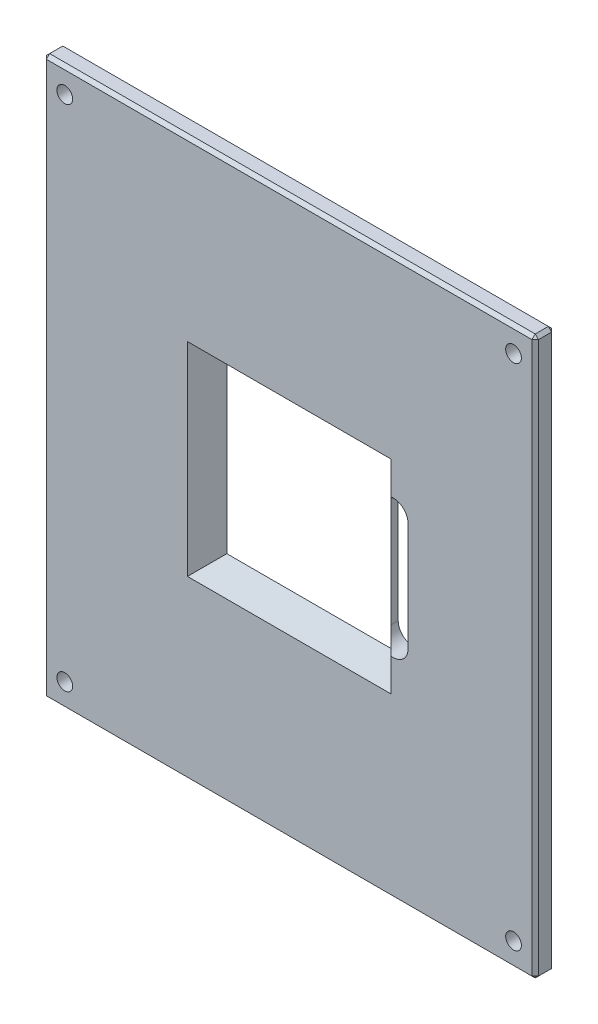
ISO-10303-21;
HEADER;
FILE_DESCRIPTION(('STEP AP214'),'2;1');
FILE_NAME('part.step','',(''),(''),'','','');
FILE_SCHEMA(('AUTOMOTIVE_DESIGN { 1 0 10303 214 1 1 1 1 }'));
ENDSEC;
DATA;
#1=APPLICATION_CONTEXT('core data for automotive mechanical design processes');
#2=APPLICATION_PROTOCOL_DEFINITION('international standard','automotive_design',2000,#1);
#3=PRODUCT_CONTEXT('',#1,'mechanical');
#4=PRODUCT('Part','Part','',(#3));
#5=PRODUCT_RELATED_PRODUCT_CATEGORY('part','',(#4));
#6=PRODUCT_DEFINITION_FORMATION('','',#4);
#7=PRODUCT_DEFINITION_CONTEXT('part definition',#1,'design');
#8=PRODUCT_DEFINITION('design','',#6,#7);
#9=PRODUCT_DEFINITION_SHAPE('','',#8);
#10=(LENGTH_UNIT() NAMED_UNIT(*) SI_UNIT(.MILLI.,.METRE.));
#11=(NAMED_UNIT(*) PLANE_ANGLE_UNIT() SI_UNIT($,.RADIAN.));
#12=(NAMED_UNIT(*) SI_UNIT($,.STERADIAN.) SOLID_ANGLE_UNIT());
#13=UNCERTAINTY_MEASURE_WITH_UNIT(LENGTH_MEASURE(1.E-05),#10,'distance_accuracy_value','');
#14=(GEOMETRIC_REPRESENTATION_CONTEXT(3) GLOBAL_UNCERTAINTY_ASSIGNED_CONTEXT((#13)) GLOBAL_UNIT_ASSIGNED_CONTEXT((#10,
#11,#12)) REPRESENTATION_CONTEXT('',''));
#15=CARTESIAN_POINT('',(0.,0.,0.));
#16=DIRECTION('',(0.,0.,1.));
#17=DIRECTION('',(1.,0.,0.));
#18=AXIS2_PLACEMENT_3D('',#15,#16,#17);
#19=CARTESIAN_POINT('',(0.,0.,3.));
#20=DIRECTION('',(0.,0.,-1.));
#21=DIRECTION('',(-1.,0.,0.));
#22=AXIS2_PLACEMENT_3D('',#19,#20,#21);
#23=PLANE('',#22);
#24=CARTESIAN_POINT('',(15.87,-8.28,3.));
#25=DIRECTION('',(0.,0.,1.));
#26=DIRECTION('',(1.,0.,0.));
#27=AXIS2_PLACEMENT_3D('',#24,#25,#26);
#28=CIRCLE('',#27,2.25);
#29=CARTESIAN_POINT('',(15.5,-10.499369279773,3.));
#30=VERTEX_POINT('',#29);
#31=CARTESIAN_POINT('',(18.12,-8.28,3.));
#32=VERTEX_POINT('',#31);
#33=EDGE_CURVE('E205',#30,#32,#28,.T.);
#34=ORIENTED_EDGE('',*,*,#33,.F.);
#35=DIRECTION('',(0.,-1.,0.));
#36=VECTOR('',#35,1.);
#37=CARTESIAN_POINT('',(15.5,-12.5,3.));
#38=LINE('',#37,#36);
#39=CARTESIAN_POINT('',(15.5,-15.5,3.));
#40=VERTEX_POINT('',#39);
#41=EDGE_CURVE('E382',#30,#40,#38,.T.);
#42=ORIENTED_EDGE('',*,*,#41,.T.);
#43=DIRECTION('',(-1.,0.,0.));
#44=VECTOR('',#43,1.);
#45=CARTESIAN_POINT('',(-12.5,-15.5,3.));
#46=LINE('',#45,#44);
#47=CARTESIAN_POINT('',(-15.5,-15.5,3.));
#48=VERTEX_POINT('',#47);
#49=EDGE_CURVE('E380',#40,#48,#46,.T.);
#50=ORIENTED_EDGE('',*,*,#49,.T.);
#51=DIRECTION('',(0.,1.,0.));
#52=VECTOR('',#51,1.);
#53=CARTESIAN_POINT('',(-15.5,12.5,3.));
#54=LINE('',#53,#52);
#55=CARTESIAN_POINT('',(-15.5,15.5,3.));
#56=VERTEX_POINT('',#55);
#57=EDGE_CURVE('E377',#48,#56,#54,.T.);
#58=ORIENTED_EDGE('',*,*,#57,.T.);
#59=DIRECTION('',(1.,0.,0.));
#60=VECTOR('',#59,1.);
#61=CARTESIAN_POINT('',(12.5,15.5,3.));
#62=LINE('',#61,#60);
#63=CARTESIAN_POINT('',(15.5,15.5,3.));
#64=VERTEX_POINT('',#63);
#65=EDGE_CURVE('E307',#56,#64,#62,.T.);
#66=ORIENTED_EDGE('',*,*,#65,.T.);
#67=DIRECTION('',(0.,-1.,0.));
#68=VECTOR('',#67,1.);
#69=CARTESIAN_POINT('',(15.5,-12.5,3.));
#70=LINE('',#69,#68);
#71=CARTESIAN_POINT('',(15.5,10.499369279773,3.));
#72=VERTEX_POINT('',#71);
#73=EDGE_CURVE('E375',#64,#72,#70,.T.);
#74=ORIENTED_EDGE('',*,*,#73,.T.);
#75=CARTESIAN_POINT('',(15.87,8.28,3.));
#76=DIRECTION('',(0.,0.,1.));
#77=DIRECTION('',(1.,0.,0.));
#78=AXIS2_PLACEMENT_3D('',#75,#76,#77);
#79=CIRCLE('',#78,2.25);
#80=CARTESIAN_POINT('',(18.12,8.28,3.));
#81=VERTEX_POINT('',#80);
#82=EDGE_CURVE('E210',#81,#72,#79,.T.);
#83=ORIENTED_EDGE('',*,*,#82,.F.);
#84=DIRECTION('',(0.,1.,0.));
#85=VECTOR('',#84,1.);
#86=CARTESIAN_POINT('',(18.12,8.28,3.));
#87=LINE('',#86,#85);
#88=EDGE_CURVE('E202',#32,#81,#87,.T.);
#89=ORIENTED_EDGE('',*,*,#88,.F.);
#90=EDGE_LOOP('',(#34,#42,#50,#58,#66,#74,#83,#89));
#91=FACE_BOUND('',#90,.T.);
#92=DIRECTION('',(0.,-1.,0.));
#93=VECTOR('',#92,1.);
#94=CARTESIAN_POINT('',(-37.,0.,3.));
#95=LINE('',#94,#93);
#96=CARTESIAN_POINT('',(-37.,42.,3.));
#97=VERTEX_POINT('',#96);
#98=CARTESIAN_POINT('',(-37.,-42.,3.));
#99=VERTEX_POINT('',#98);
#100=EDGE_CURVE('E302',#97,#99,#95,.T.);
#101=ORIENTED_EDGE('',*,*,#100,.T.);
#102=DIRECTION('',(1.,0.,0.));
#103=VECTOR('',#102,1.);
#104=CARTESIAN_POINT('',(0.,-42.,3.));
#105=LINE('',#104,#103);
#106=CARTESIAN_POINT('',(37.,-42.,3.));
#107=VERTEX_POINT('',#106);
#108=EDGE_CURVE('E304',#99,#107,#105,.T.);
#109=ORIENTED_EDGE('',*,*,#108,.T.);
#110=DIRECTION('',(0.,1.,0.));
#111=VECTOR('',#110,1.);
#112=CARTESIAN_POINT('',(37.,0.,3.));
#113=LINE('',#112,#111);
#114=CARTESIAN_POINT('',(37.,42.,3.));
#115=VERTEX_POINT('',#114);
#116=EDGE_CURVE('E298',#107,#115,#113,.T.);
#117=ORIENTED_EDGE('',*,*,#116,.T.);
#118=DIRECTION('',(-1.,0.,0.));
#119=VECTOR('',#118,1.);
#120=CARTESIAN_POINT('',(0.,42.,3.));
#121=LINE('',#120,#119);
#122=EDGE_CURVE('E300',#115,#97,#121,.T.);
#123=ORIENTED_EDGE('',*,*,#122,.T.);
#124=EDGE_LOOP('',(#101,#109,#117,#123));
#125=FACE_BOUND('',#124,.T.);
#126=CARTESIAN_POINT('',(-34.1918918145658,38.7508107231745,3.));
#127=DIRECTION('',(0.,0.,1.));
#128=DIRECTION('',(1.,0.,0.));
#129=AXIS2_PLACEMENT_3D('',#126,#127,#128);
#130=CIRCLE('',#129,1.2);
#131=CARTESIAN_POINT('',(-32.9918918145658,38.7508107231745,3.));
#132=VERTEX_POINT('',#131);
#133=EDGE_CURVE('E216',#132,#132,#130,.T.);
#134=ORIENTED_EDGE('',*,*,#133,.F.);
#135=EDGE_LOOP('',(#134));
#136=FACE_BOUND('',#135,.T.);
#137=CARTESIAN_POINT('',(34.1918918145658,38.7508107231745,3.));
#138=DIRECTION('',(0.,0.,1.));
#139=DIRECTION('',(1.,0.,0.));
#140=AXIS2_PLACEMENT_3D('',#137,#138,#139);
#141=CIRCLE('',#140,1.2);
#142=CARTESIAN_POINT('',(35.3918918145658,38.7508107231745,3.));
#143=VERTEX_POINT('',#142);
#144=EDGE_CURVE('E226',#143,#143,#141,.T.);
#145=ORIENTED_EDGE('',*,*,#144,.F.);
#146=EDGE_LOOP('',(#145));
#147=FACE_BOUND('',#146,.T.);
#148=CARTESIAN_POINT('',(-34.1918918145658,-38.7508107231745,3.));
#149=DIRECTION('',(0.,0.,1.));
#150=DIRECTION('',(1.,0.,0.));
#151=AXIS2_PLACEMENT_3D('',#148,#149,#150);
#152=CIRCLE('',#151,1.2);
#153=CARTESIAN_POINT('',(-32.9918918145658,-38.7508107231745,3.));
#154=VERTEX_POINT('',#153);
#155=EDGE_CURVE('E232',#154,#154,#152,.T.);
#156=ORIENTED_EDGE('',*,*,#155,.F.);
#157=EDGE_LOOP('',(#156));
#158=FACE_BOUND('',#157,.T.);
#159=CARTESIAN_POINT('',(34.1918918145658,-38.7508107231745,3.));
#160=DIRECTION('',(0.,0.,1.));
#161=DIRECTION('',(1.,0.,0.));
#162=AXIS2_PLACEMENT_3D('',#159,#160,#161);
#163=CIRCLE('',#162,1.2);
#164=CARTESIAN_POINT('',(35.3918918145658,-38.7508107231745,3.));
#165=VERTEX_POINT('',#164);
#166=EDGE_CURVE('E238',#165,#165,#163,.T.);
#167=ORIENTED_EDGE('',*,*,#166,.F.);
#168=EDGE_LOOP('',(#167));
#169=FACE_BOUND('',#168,.T.);
#170=ADVANCED_FACE('F39',(#91,#125,#136,#147,#158,#169),#23,.F.);
#171=CARTESIAN_POINT('',(0.,0.,0.));
#172=DIRECTION('',(0.,0.,-1.));
#173=DIRECTION('',(-1.,0.,0.));
#174=AXIS2_PLACEMENT_3D('',#171,#172,#173);
#175=PLANE('',#174);
#176=DIRECTION('',(0.,1.,0.));
#177=VECTOR('',#176,1.);
#178=CARTESIAN_POINT('',(-37.,42.5,0.));
#179=LINE('',#178,#177);
#180=CARTESIAN_POINT('',(-37.,-42.,0.));
#181=VERTEX_POINT('',#180);
#182=CARTESIAN_POINT('',(-37.,42.,0.));
#183=VERTEX_POINT('',#182);
#184=EDGE_CURVE('E266',#181,#183,#179,.T.);
#185=ORIENTED_EDGE('',*,*,#184,.T.);
#186=DIRECTION('',(1.,0.,0.));
#187=VECTOR('',#186,1.);
#188=CARTESIAN_POINT('',(37.5,42.,0.));
#189=LINE('',#188,#187);
#190=CARTESIAN_POINT('',(37.,42.,0.));
#191=VERTEX_POINT('',#190);
#192=EDGE_CURVE('E268',#183,#191,#189,.T.);
#193=ORIENTED_EDGE('',*,*,#192,.T.);
#194=DIRECTION('',(0.,-1.,0.));
#195=VECTOR('',#194,1.);
#196=CARTESIAN_POINT('',(37.,-42.5,0.));
#197=LINE('',#196,#195);
#198=CARTESIAN_POINT('',(37.,-42.,0.));
#199=VERTEX_POINT('',#198);
#200=EDGE_CURVE('E262',#191,#199,#197,.T.);
#201=ORIENTED_EDGE('',*,*,#200,.T.);
#202=DIRECTION('',(-1.,0.,0.));
#203=VECTOR('',#202,1.);
#204=CARTESIAN_POINT('',(-37.5,-42.,0.));
#205=LINE('',#204,#203);
#206=EDGE_CURVE('E264',#199,#181,#205,.T.);
#207=ORIENTED_EDGE('',*,*,#206,.T.);
#208=EDGE_LOOP('',(#185,#193,#201,#207));
#209=FACE_BOUND('',#208,.T.);
#210=CARTESIAN_POINT('',(15.87,8.28,0.));
#211=DIRECTION('',(0.,0.,1.));
#212=DIRECTION('',(1.,0.,0.));
#213=AXIS2_PLACEMENT_3D('',#210,#211,#212);
#214=CIRCLE('',#213,2.25);
#215=CARTESIAN_POINT('',(18.12,8.28,0.));
#216=VERTEX_POINT('',#215);
#217=CARTESIAN_POINT('',(13.62,8.28,0.));
#218=VERTEX_POINT('',#217);
#219=EDGE_CURVE('E187',#216,#218,#214,.T.);
#220=ORIENTED_EDGE('',*,*,#219,.T.);
#221=DIRECTION('',(0.,-1.,0.));
#222=VECTOR('',#221,1.);
#223=CARTESIAN_POINT('',(13.62,8.28,0.));
#224=LINE('',#223,#222);
#225=CARTESIAN_POINT('',(13.62,-8.28,0.));
#226=VERTEX_POINT('',#225);
#227=EDGE_CURVE('E193',#218,#226,#224,.T.);
#228=ORIENTED_EDGE('',*,*,#227,.T.);
#229=CARTESIAN_POINT('',(15.87,-8.28,0.));
#230=DIRECTION('',(0.,0.,1.));
#231=DIRECTION('',(1.,0.,0.));
#232=AXIS2_PLACEMENT_3D('',#229,#230,#231);
#233=CIRCLE('',#232,2.25);
#234=CARTESIAN_POINT('',(18.12,-8.28,0.));
#235=VERTEX_POINT('',#234);
#236=EDGE_CURVE('E197',#226,#235,#233,.T.);
#237=ORIENTED_EDGE('',*,*,#236,.T.);
#238=DIRECTION('',(0.,1.,0.));
#239=VECTOR('',#238,1.);
#240=CARTESIAN_POINT('',(18.12,8.28,0.));
#241=LINE('',#240,#239);
#242=EDGE_CURVE('E190',#235,#216,#241,.T.);
#243=ORIENTED_EDGE('',*,*,#242,.T.);
#244=EDGE_LOOP('',(#220,#228,#237,#243));
#245=FACE_BOUND('',#244,.T.);
#246=CARTESIAN_POINT('',(-34.1918918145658,38.7508107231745,0.));
#247=DIRECTION('',(0.,0.,1.));
#248=DIRECTION('',(1.,0.,0.));
#249=AXIS2_PLACEMENT_3D('',#246,#247,#248);
#250=CIRCLE('',#249,1.2);
#251=CARTESIAN_POINT('',(-32.9918918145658,38.7508107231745,0.));
#252=VERTEX_POINT('',#251);
#253=EDGE_CURVE('E223',#252,#252,#250,.T.);
#254=ORIENTED_EDGE('',*,*,#253,.T.);
#255=EDGE_LOOP('',(#254));
#256=FACE_BOUND('',#255,.T.);
#257=CARTESIAN_POINT('',(34.1918918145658,38.7508107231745,0.));
#258=DIRECTION('',(0.,0.,1.));
#259=DIRECTION('',(1.,0.,0.));
#260=AXIS2_PLACEMENT_3D('',#257,#258,#259);
#261=CIRCLE('',#260,1.2);
#262=CARTESIAN_POINT('',(35.3918918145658,38.7508107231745,0.));
#263=VERTEX_POINT('',#262);
#264=EDGE_CURVE('E229',#263,#263,#261,.T.);
#265=ORIENTED_EDGE('',*,*,#264,.T.);
#266=EDGE_LOOP('',(#265));
#267=FACE_BOUND('',#266,.T.);
#268=CARTESIAN_POINT('',(-34.1918918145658,-38.7508107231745,0.));
#269=DIRECTION('',(0.,0.,1.));
#270=DIRECTION('',(1.,0.,0.));
#271=AXIS2_PLACEMENT_3D('',#268,#269,#270);
#272=CIRCLE('',#271,1.2);
#273=CARTESIAN_POINT('',(-32.9918918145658,-38.7508107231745,0.));
#274=VERTEX_POINT('',#273);
#275=EDGE_CURVE('E235',#274,#274,#272,.T.);
#276=ORIENTED_EDGE('',*,*,#275,.T.);
#277=EDGE_LOOP('',(#276));
#278=FACE_BOUND('',#277,.T.);
#279=CARTESIAN_POINT('',(34.1918918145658,-38.7508107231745,0.));
#280=DIRECTION('',(0.,0.,1.));
#281=DIRECTION('',(1.,0.,0.));
#282=AXIS2_PLACEMENT_3D('',#279,#280,#281);
#283=CIRCLE('',#282,1.2);
#284=CARTESIAN_POINT('',(35.3918918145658,-38.7508107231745,0.));
#285=VERTEX_POINT('',#284);
#286=EDGE_CURVE('E241',#285,#285,#283,.T.);
#287=ORIENTED_EDGE('',*,*,#286,.T.);
#288=EDGE_LOOP('',(#287));
#289=FACE_BOUND('',#288,.T.);
#290=DIRECTION('',(0.,1.,0.));
#291=VECTOR('',#290,1.);
#292=CARTESIAN_POINT('',(12.5,12.5,0.));
#293=LINE('',#292,#291);
#294=CARTESIAN_POINT('',(12.5,-12.5,0.));
#295=VERTEX_POINT('',#294);
#296=CARTESIAN_POINT('',(12.5,12.5,0.));
#297=VERTEX_POINT('',#296);
#298=EDGE_CURVE('E251',#295,#297,#293,.T.);
#299=ORIENTED_EDGE('',*,*,#298,.T.);
#300=DIRECTION('',(-1.,0.,0.));
#301=VECTOR('',#300,1.);
#302=CARTESIAN_POINT('',(-12.5,12.5,0.));
#303=LINE('',#302,#301);
#304=CARTESIAN_POINT('',(-12.5,12.5,0.));
#305=VERTEX_POINT('',#304);
#306=EDGE_CURVE('E244',#297,#305,#303,.T.);
#307=ORIENTED_EDGE('',*,*,#306,.T.);
#308=DIRECTION('',(0.,-1.,0.));
#309=VECTOR('',#308,1.);
#310=CARTESIAN_POINT('',(-12.5,-12.5,0.));
#311=LINE('',#310,#309);
#312=CARTESIAN_POINT('',(-12.5,-12.5,0.));
#313=VERTEX_POINT('',#312);
#314=EDGE_CURVE('E246',#305,#313,#311,.T.);
#315=ORIENTED_EDGE('',*,*,#314,.T.);
#316=DIRECTION('',(1.,0.,0.));
#317=VECTOR('',#316,1.);
#318=CARTESIAN_POINT('',(12.5,-12.5,0.));
#319=LINE('',#318,#317);
#320=EDGE_CURVE('E249',#313,#295,#319,.T.);
#321=ORIENTED_EDGE('',*,*,#320,.T.);
#322=EDGE_LOOP('',(#299,#307,#315,#321));
#323=FACE_BOUND('',#322,.T.);
#324=ADVANCED_FACE('F199',(#209,#245,#256,#267,#278,#289,#323),#175,.T.);
#325=CARTESIAN_POINT('',(37.5,-42.5,3.));
#326=DIRECTION('',(-1.,0.,0.));
#327=DIRECTION('',(0.,-1.,0.));
#328=AXIS2_PLACEMENT_3D('',#325,#326,#327);
#329=PLANE('',#328);
#330=DIRECTION('',(0.,0.,-1.));
#331=VECTOR('',#330,1.);
#332=CARTESIAN_POINT('',(37.5,-42.,3.));
#333=LINE('',#332,#331);
#334=CARTESIAN_POINT('',(37.5,-42.,2.50000000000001));
#335=VERTEX_POINT('',#334);
#336=CARTESIAN_POINT('',(37.5,-42.,0.499999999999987));
#337=VERTEX_POINT('',#336);
#338=EDGE_CURVE('E293',#335,#337,#333,.T.);
#339=ORIENTED_EDGE('',*,*,#338,.T.);
#340=DIRECTION('',(0.,1.,0.));
#341=VECTOR('',#340,1.);
#342=CARTESIAN_POINT('',(37.5,42.5,0.499999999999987));
#343=LINE('',#342,#341);
#344=CARTESIAN_POINT('',(37.5,42.,0.499999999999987));
#345=VERTEX_POINT('',#344);
#346=EDGE_CURVE('E295',#337,#345,#343,.T.);
#347=ORIENTED_EDGE('',*,*,#346,.T.);
#348=DIRECTION('',(0.,0.,1.));
#349=VECTOR('',#348,1.);
#350=CARTESIAN_POINT('',(37.5,42.,3.));
#351=LINE('',#350,#349);
#352=CARTESIAN_POINT('',(37.5,42.,2.50000000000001));
#353=VERTEX_POINT('',#352);
#354=EDGE_CURVE('E289',#345,#353,#351,.T.);
#355=ORIENTED_EDGE('',*,*,#354,.T.);
#356=DIRECTION('',(0.,-1.,0.));
#357=VECTOR('',#356,1.);
#358=CARTESIAN_POINT('',(37.5,-42.5,2.50000000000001));
#359=LINE('',#358,#357);
#360=EDGE_CURVE('E291',#353,#335,#359,.T.);
#361=ORIENTED_EDGE('',*,*,#360,.T.);
#362=EDGE_LOOP('',(#339,#347,#355,#361));
#363=FACE_BOUND('',#362,.T.);
#364=ADVANCED_FACE('F423',(#363),#329,.F.);
#365=CARTESIAN_POINT('',(-37.5,42.5,3.));
#366=DIRECTION('',(0.,-1.,0.));
#367=DIRECTION('',(0.,0.,-1.));
#368=AXIS2_PLACEMENT_3D('',#365,#366,#367);
#369=PLANE('',#368);
#370=DIRECTION('',(0.,0.,-1.));
#371=VECTOR('',#370,1.);
#372=CARTESIAN_POINT('',(37.,42.5,3.));
#373=LINE('',#372,#371);
#374=CARTESIAN_POINT('',(37.,42.5,2.50000000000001));
#375=VERTEX_POINT('',#374);
#376=CARTESIAN_POINT('',(37.,42.5,0.499999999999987));
#377=VERTEX_POINT('',#376);
#378=EDGE_CURVE('E253',#375,#377,#373,.T.);
#379=ORIENTED_EDGE('',*,*,#378,.T.);
#380=DIRECTION('',(-1.,0.,0.));
#381=VECTOR('',#380,1.);
#382=CARTESIAN_POINT('',(-37.5,42.5,0.499999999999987));
#383=LINE('',#382,#381);
#384=CARTESIAN_POINT('',(-37.,42.5,0.499999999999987));
#385=VERTEX_POINT('',#384);
#386=EDGE_CURVE('E259',#377,#385,#383,.T.);
#387=ORIENTED_EDGE('',*,*,#386,.T.);
#388=DIRECTION('',(0.,0.,1.));
#389=VECTOR('',#388,1.);
#390=CARTESIAN_POINT('',(-37.,42.5,3.));
#391=LINE('',#390,#389);
#392=CARTESIAN_POINT('',(-37.,42.5,2.50000000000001));
#393=VERTEX_POINT('',#392);
#394=EDGE_CURVE('E257',#385,#393,#391,.T.);
#395=ORIENTED_EDGE('',*,*,#394,.T.);
#396=DIRECTION('',(1.,0.,0.));
#397=VECTOR('',#396,1.);
#398=CARTESIAN_POINT('',(-37.5,42.5,2.50000000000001));
#399=LINE('',#398,#397);
#400=EDGE_CURVE('E255',#393,#375,#399,.T.);
#401=ORIENTED_EDGE('',*,*,#400,.T.);
#402=EDGE_LOOP('',(#379,#387,#395,#401));
#403=FACE_BOUND('',#402,.T.);
#404=ADVANCED_FACE('F430',(#403),#369,.F.);
#405=CARTESIAN_POINT('',(-37.5,-42.5,3.));
#406=DIRECTION('',(1.,0.,0.));
#407=DIRECTION('',(0.,0.,-1.));
#408=AXIS2_PLACEMENT_3D('',#405,#406,#407);
#409=PLANE('',#408);
#410=DIRECTION('',(0.,0.,-1.));
#411=VECTOR('',#410,1.);
#412=CARTESIAN_POINT('',(-37.5,42.,3.));
#413=LINE('',#412,#411);
#414=CARTESIAN_POINT('',(-37.5,42.,2.50000000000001));
#415=VERTEX_POINT('',#414);
#416=CARTESIAN_POINT('',(-37.5,42.,0.499999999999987));
#417=VERTEX_POINT('',#416);
#418=EDGE_CURVE('E271',#415,#417,#413,.T.);
#419=ORIENTED_EDGE('',*,*,#418,.T.);
#420=DIRECTION('',(0.,-1.,0.));
#421=VECTOR('',#420,1.);
#422=CARTESIAN_POINT('',(-37.5,-42.5,0.499999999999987));
#423=LINE('',#422,#421);
#424=CARTESIAN_POINT('',(-37.5,-42.,0.499999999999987));
#425=VERTEX_POINT('',#424);
#426=EDGE_CURVE('E277',#417,#425,#423,.T.);
#427=ORIENTED_EDGE('',*,*,#426,.T.);
#428=DIRECTION('',(0.,0.,1.));
#429=VECTOR('',#428,1.);
#430=CARTESIAN_POINT('',(-37.5,-42.,3.));
#431=LINE('',#430,#429);
#432=CARTESIAN_POINT('',(-37.5,-42.,2.50000000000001));
#433=VERTEX_POINT('',#432);
#434=EDGE_CURVE('E275',#425,#433,#431,.T.);
#435=ORIENTED_EDGE('',*,*,#434,.T.);
#436=DIRECTION('',(0.,1.,0.));
#437=VECTOR('',#436,1.);
#438=CARTESIAN_POINT('',(-37.5,-42.5,2.50000000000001));
#439=LINE('',#438,#437);
#440=EDGE_CURVE('E273',#433,#415,#439,.T.);
#441=ORIENTED_EDGE('',*,*,#440,.T.);
#442=EDGE_LOOP('',(#419,#427,#435,#441));
#443=FACE_BOUND('',#442,.T.);
#444=ADVANCED_FACE('F440',(#443),#409,.F.);
#445=CARTESIAN_POINT('',(-37.5,-42.5,3.));
#446=DIRECTION('',(0.,1.,0.));
#447=DIRECTION('',(-1.,0.,0.));
#448=AXIS2_PLACEMENT_3D('',#445,#446,#447);
#449=PLANE('',#448);
#450=DIRECTION('',(0.,0.,-1.));
#451=VECTOR('',#450,1.);
#452=CARTESIAN_POINT('',(-37.,-42.5,3.));
#453=LINE('',#452,#451);
#454=CARTESIAN_POINT('',(-37.,-42.5,2.50000000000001));
#455=VERTEX_POINT('',#454);
#456=CARTESIAN_POINT('',(-37.,-42.5,0.499999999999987));
#457=VERTEX_POINT('',#456);
#458=EDGE_CURVE('E280',#455,#457,#453,.T.);
#459=ORIENTED_EDGE('',*,*,#458,.T.);
#460=DIRECTION('',(1.,0.,0.));
#461=VECTOR('',#460,1.);
#462=CARTESIAN_POINT('',(37.5,-42.5,0.499999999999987));
#463=LINE('',#462,#461);
#464=CARTESIAN_POINT('',(37.,-42.5,0.499999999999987));
#465=VERTEX_POINT('',#464);
#466=EDGE_CURVE('E286',#457,#465,#463,.T.);
#467=ORIENTED_EDGE('',*,*,#466,.T.);
#468=DIRECTION('',(0.,0.,1.));
#469=VECTOR('',#468,1.);
#470=CARTESIAN_POINT('',(37.,-42.5,3.));
#471=LINE('',#470,#469);
#472=CARTESIAN_POINT('',(37.,-42.5,2.50000000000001));
#473=VERTEX_POINT('',#472);
#474=EDGE_CURVE('E284',#465,#473,#471,.T.);
#475=ORIENTED_EDGE('',*,*,#474,.T.);
#476=DIRECTION('',(-1.,0.,0.));
#477=VECTOR('',#476,1.);
#478=CARTESIAN_POINT('',(-37.5,-42.5,2.50000000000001));
#479=LINE('',#478,#477);
#480=EDGE_CURVE('E282',#473,#455,#479,.T.);
#481=ORIENTED_EDGE('',*,*,#480,.T.);
#482=EDGE_LOOP('',(#459,#467,#475,#481));
#483=FACE_BOUND('',#482,.T.);
#484=ADVANCED_FACE('F436',(#483),#449,.F.);
#485=CARTESIAN_POINT('',(34.1918918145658,-38.7508107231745,3.));
#486=DIRECTION('',(0.,0.,1.));
#487=DIRECTION('',(1.,0.,0.));
#488=AXIS2_PLACEMENT_3D('',#485,#486,#487);
#489=CYLINDRICAL_SURFACE('',#488,1.2);
#490=ORIENTED_EDGE('',*,*,#286,.F.);
#491=EDGE_LOOP('',(#490));
#492=FACE_BOUND('',#491,.T.);
#493=ORIENTED_EDGE('',*,*,#166,.T.);
#494=EDGE_LOOP('',(#493));
#495=FACE_BOUND('',#494,.T.);
#496=ADVANCED_FACE('F439',(#492,#495),#489,.F.);
#497=CARTESIAN_POINT('',(-34.1918918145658,-38.7508107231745,3.));
#498=DIRECTION('',(0.,0.,1.));
#499=DIRECTION('',(1.,0.,0.));
#500=AXIS2_PLACEMENT_3D('',#497,#498,#499);
#501=CYLINDRICAL_SURFACE('',#500,1.2);
#502=ORIENTED_EDGE('',*,*,#275,.F.);
#503=EDGE_LOOP('',(#502));
#504=FACE_BOUND('',#503,.T.);
#505=ORIENTED_EDGE('',*,*,#155,.T.);
#506=EDGE_LOOP('',(#505));
#507=FACE_BOUND('',#506,.T.);
#508=ADVANCED_FACE('F729',(#504,#507),#501,.F.);
#509=CARTESIAN_POINT('',(34.1918918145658,38.7508107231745,3.));
#510=DIRECTION('',(0.,0.,1.));
#511=DIRECTION('',(1.,0.,0.));
#512=AXIS2_PLACEMENT_3D('',#509,#510,#511);
#513=CYLINDRICAL_SURFACE('',#512,1.2);
#514=ORIENTED_EDGE('',*,*,#264,.F.);
#515=EDGE_LOOP('',(#514));
#516=FACE_BOUND('',#515,.T.);
#517=ORIENTED_EDGE('',*,*,#144,.T.);
#518=EDGE_LOOP('',(#517));
#519=FACE_BOUND('',#518,.T.);
#520=ADVANCED_FACE('F721',(#516,#519),#513,.F.);
#521=CARTESIAN_POINT('',(-34.1918918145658,38.7508107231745,3.));
#522=DIRECTION('',(0.,0.,1.));
#523=DIRECTION('',(1.,0.,0.));
#524=AXIS2_PLACEMENT_3D('',#521,#522,#523);
#525=CYLINDRICAL_SURFACE('',#524,1.2);
#526=ORIENTED_EDGE('',*,*,#253,.F.);
#527=EDGE_LOOP('',(#526));
#528=FACE_BOUND('',#527,.T.);
#529=ORIENTED_EDGE('',*,*,#133,.T.);
#530=EDGE_LOOP('',(#529));
#531=FACE_BOUND('',#530,.T.);
#532=ADVANCED_FACE('F715',(#528,#531),#525,.F.);
#533=CARTESIAN_POINT('',(15.87,8.28,0.));
#534=DIRECTION('',(0.,0.,1.));
#535=DIRECTION('',(1.,0.,0.));
#536=AXIS2_PLACEMENT_3D('',#533,#534,#535);
#537=CYLINDRICAL_SURFACE('',#536,2.25);
#538=ORIENTED_EDGE('',*,*,#82,.T.);
#539=CARTESIAN_POINT('',(15.87,8.28,3.36999999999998));
#540=DIRECTION('',(-0.707106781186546,0.,0.707106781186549));
#541=DIRECTION('',(0.707106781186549,0.,0.707106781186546));
#542=AXIS2_PLACEMENT_3D('',#539,#540,#541);
#543=ELLIPSE('',#542,3.18198051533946,2.25);
#544=CARTESIAN_POINT('',(13.62,8.28,1.11999999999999));
#545=VERTEX_POINT('',#544);
#546=EDGE_CURVE('E64',#72,#545,#543,.T.);
#547=ORIENTED_EDGE('',*,*,#546,.T.);
#548=DIRECTION('',(0.,0.,1.));
#549=VECTOR('',#548,1.);
#550=CARTESIAN_POINT('',(13.62,8.28,0.));
#551=LINE('',#550,#549);
#552=EDGE_CURVE('E183',#218,#545,#551,.T.);
#553=ORIENTED_EDGE('',*,*,#552,.F.);
#554=ORIENTED_EDGE('',*,*,#219,.F.);
#555=DIRECTION('',(0.,0.,1.));
#556=VECTOR('',#555,1.);
#557=CARTESIAN_POINT('',(18.12,8.28,0.));
#558=LINE('',#557,#556);
#559=EDGE_CURVE('E214',#216,#81,#558,.T.);
#560=ORIENTED_EDGE('',*,*,#559,.T.);
#561=EDGE_LOOP('',(#538,#547,#553,#554,#560));
#562=FACE_BOUND('',#561,.T.);
#563=ADVANCED_FACE('F185',(#562),#537,.F.);
#564=CARTESIAN_POINT('',(18.12,8.28,0.));
#565=DIRECTION('',(1.,0.,0.));
#566=DIRECTION('',(0.,0.,-1.));
#567=AXIS2_PLACEMENT_3D('',#564,#565,#566);
#568=PLANE('',#567);
#569=ORIENTED_EDGE('',*,*,#88,.T.);
#570=ORIENTED_EDGE('',*,*,#559,.F.);
#571=ORIENTED_EDGE('',*,*,#242,.F.);
#572=DIRECTION('',(0.,0.,1.));
#573=VECTOR('',#572,1.);
#574=CARTESIAN_POINT('',(18.12,-8.28,0.));
#575=LINE('',#574,#573);
#576=EDGE_CURVE('E217',#235,#32,#575,.T.);
#577=ORIENTED_EDGE('',*,*,#576,.T.);
#578=EDGE_LOOP('',(#569,#570,#571,#577));
#579=FACE_BOUND('',#578,.T.);
#580=ADVANCED_FACE('F411',(#579),#568,.F.);
#581=CARTESIAN_POINT('',(15.87,-8.28,0.));
#582=DIRECTION('',(0.,0.,1.));
#583=DIRECTION('',(1.,0.,0.));
#584=AXIS2_PLACEMENT_3D('',#581,#582,#583);
#585=CYLINDRICAL_SURFACE('',#584,2.25);
#586=DIRECTION('',(0.,0.,1.));
#587=VECTOR('',#586,1.);
#588=CARTESIAN_POINT('',(13.62,-8.28,0.));
#589=LINE('',#588,#587);
#590=CARTESIAN_POINT('',(13.62,-8.28,1.11999999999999));
#591=VERTEX_POINT('',#590);
#592=EDGE_CURVE('E189',#226,#591,#589,.T.);
#593=ORIENTED_EDGE('',*,*,#592,.T.);
#594=CARTESIAN_POINT('',(15.87,-8.28,3.36999999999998));
#595=DIRECTION('',(-0.707106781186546,0.,0.707106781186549));
#596=DIRECTION('',(0.707106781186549,0.,0.707106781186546));
#597=AXIS2_PLACEMENT_3D('',#594,#595,#596);
#598=ELLIPSE('',#597,3.18198051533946,2.25);
#599=EDGE_CURVE('E11',#591,#30,#598,.T.);
#600=ORIENTED_EDGE('',*,*,#599,.T.);
#601=ORIENTED_EDGE('',*,*,#33,.T.);
#602=ORIENTED_EDGE('',*,*,#576,.F.);
#603=ORIENTED_EDGE('',*,*,#236,.F.);
#604=EDGE_LOOP('',(#593,#600,#601,#602,#603));
#605=FACE_BOUND('',#604,.T.);
#606=ADVANCED_FACE('F694',(#605),#585,.F.);
#607=CARTESIAN_POINT('',(13.62,8.28,0.));
#608=DIRECTION('',(-1.,0.,0.));
#609=DIRECTION('',(0.,0.,1.));
#610=AXIS2_PLACEMENT_3D('',#607,#608,#609);
#611=PLANE('',#610);
#612=ORIENTED_EDGE('',*,*,#552,.T.);
#613=DIRECTION('',(0.,-1.,0.));
#614=VECTOR('',#613,1.);
#615=CARTESIAN_POINT('',(13.62,12.5,1.11999999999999));
#616=LINE('',#615,#614);
#617=EDGE_CURVE('E49',#545,#591,#616,.T.);
#618=ORIENTED_EDGE('',*,*,#617,.T.);
#619=ORIENTED_EDGE('',*,*,#592,.F.);
#620=ORIENTED_EDGE('',*,*,#227,.F.);
#621=EDGE_LOOP('',(#612,#618,#619,#620));
#622=FACE_BOUND('',#621,.T.);
#623=ADVANCED_FACE('F194',(#622),#611,.F.);
#624=CARTESIAN_POINT('',(0.,-42.,3.));
#625=DIRECTION('',(0.,0.707106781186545,-0.70710678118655));
#626=DIRECTION('',(1.,0.,0.));
#627=AXIS2_PLACEMENT_3D('',#624,#625,#626);
#628=PLANE('',#627);
#629=DIRECTION('',(0.,0.70710678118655,0.707106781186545));
#630=VECTOR('',#629,1.);
#631=CARTESIAN_POINT('',(37.,-42.5,2.50000000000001));
#632=LINE('',#631,#630);
#633=EDGE_CURVE('E212',#107,#473,#632,.F.);
#634=ORIENTED_EDGE('',*,*,#633,.F.);
#635=ORIENTED_EDGE('',*,*,#108,.F.);
#636=DIRECTION('',(0.,-0.70710678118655,-0.707106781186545));
#637=VECTOR('',#636,1.);
#638=CARTESIAN_POINT('',(-37.,-42.5,2.50000000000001));
#639=LINE('',#638,#637);
#640=EDGE_CURVE('E369',#455,#99,#639,.F.);
#641=ORIENTED_EDGE('',*,*,#640,.F.);
#642=ORIENTED_EDGE('',*,*,#480,.F.);
#643=EDGE_LOOP('',(#634,#635,#641,#642));
#644=FACE_BOUND('',#643,.T.);
#645=ADVANCED_FACE('F581',(#644),#628,.F.);
#646=CARTESIAN_POINT('',(37.,-42.5,2.50000000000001));
#647=DIRECTION('',(0.577350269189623,-0.577350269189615,0.577350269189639));
#648=DIRECTION('',(0.707106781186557,0.,-0.707106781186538));
#649=AXIS2_PLACEMENT_3D('',#646,#647,#648);
#650=PLANE('',#649);
#651=DIRECTION('',(0.70710678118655,0.,-0.707106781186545));
#652=VECTOR('',#651,1.);
#653=CARTESIAN_POINT('',(37.25,-42.,2.75));
#654=LINE('',#653,#652);
#655=EDGE_CURVE('E363',#107,#335,#654,.T.);
#656=ORIENTED_EDGE('',*,*,#655,.F.);
#657=ORIENTED_EDGE('',*,*,#633,.T.);
#658=DIRECTION('',(-0.707106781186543,-0.707106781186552,0.));
#659=VECTOR('',#658,1.);
#660=CARTESIAN_POINT('',(37.,-42.5,2.50000000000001));
#661=LINE('',#660,#659);
#662=EDGE_CURVE('E366',#335,#473,#661,.T.);
#663=ORIENTED_EDGE('',*,*,#662,.F.);
#664=EDGE_LOOP('',(#656,#657,#663));
#665=FACE_BOUND('',#664,.T.);
#666=ADVANCED_FACE('F574',(#665),#650,.T.);
#667=CARTESIAN_POINT('',(-37.,-42.5,2.50000000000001));
#668=DIRECTION('',(-0.577350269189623,-0.577350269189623,0.577350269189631));
#669=DIRECTION('',(0.707106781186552,0.,0.707106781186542));
#670=AXIS2_PLACEMENT_3D('',#667,#668,#669);
#671=PLANE('',#670);
#672=DIRECTION('',(-0.707106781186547,0.707106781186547,0.));
#673=VECTOR('',#672,1.);
#674=CARTESIAN_POINT('',(-37.,-42.5,2.50000000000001));
#675=LINE('',#674,#673);
#676=EDGE_CURVE('E357',#455,#433,#675,.T.);
#677=ORIENTED_EDGE('',*,*,#676,.F.);
#678=ORIENTED_EDGE('',*,*,#640,.T.);
#679=DIRECTION('',(0.707106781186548,0.,0.707106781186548));
#680=VECTOR('',#679,1.);
#681=CARTESIAN_POINT('',(-37.25,-42.,2.75));
#682=LINE('',#681,#680);
#683=EDGE_CURVE('E360',#433,#99,#682,.T.);
#684=ORIENTED_EDGE('',*,*,#683,.F.);
#685=EDGE_LOOP('',(#677,#678,#684));
#686=FACE_BOUND('',#685,.T.);
#687=ADVANCED_FACE('F567',(#686),#671,.T.);
#688=CARTESIAN_POINT('',(37.5,-42.,3.));
#689=DIRECTION('',(-0.707106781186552,0.707106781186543,0.));
#690=DIRECTION('',(0.,0.,-1.));
#691=AXIS2_PLACEMENT_3D('',#688,#689,#690);
#692=PLANE('',#691);
#693=ORIENTED_EDGE('',*,*,#662,.T.);
#694=ORIENTED_EDGE('',*,*,#474,.F.);
#695=DIRECTION('',(0.707106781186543,0.707106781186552,0.));
#696=VECTOR('',#695,1.);
#697=CARTESIAN_POINT('',(37.,-42.5,0.499999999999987));
#698=LINE('',#697,#696);
#699=EDGE_CURVE('E352',#337,#465,#698,.F.);
#700=ORIENTED_EDGE('',*,*,#699,.F.);
#701=ORIENTED_EDGE('',*,*,#338,.F.);
#702=EDGE_LOOP('',(#693,#694,#700,#701));
#703=FACE_BOUND('',#702,.T.);
#704=ADVANCED_FACE('F560',(#703),#692,.F.);
#705=CARTESIAN_POINT('',(37.,0.,3.));
#706=DIRECTION('',(-0.707106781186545,0.,-0.70710678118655));
#707=DIRECTION('',(0.,1.,0.));
#708=AXIS2_PLACEMENT_3D('',#705,#706,#707);
#709=PLANE('',#708);
#710=ORIENTED_EDGE('',*,*,#655,.T.);
#711=ORIENTED_EDGE('',*,*,#360,.F.);
#712=DIRECTION('',(-0.70710678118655,0.,0.707106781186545));
#713=VECTOR('',#712,1.);
#714=CARTESIAN_POINT('',(37.25,42.,2.74999999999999));
#715=LINE('',#714,#713);
#716=EDGE_CURVE('E349',#115,#353,#715,.F.);
#717=ORIENTED_EDGE('',*,*,#716,.F.);
#718=ORIENTED_EDGE('',*,*,#116,.F.);
#719=EDGE_LOOP('',(#710,#711,#717,#718));
#720=FACE_BOUND('',#719,.T.);
#721=ADVANCED_FACE('F553',(#720),#709,.F.);
#722=CARTESIAN_POINT('',(0.,42.,3.));
#723=DIRECTION('',(0.,-0.707106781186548,-0.707106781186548));
#724=DIRECTION('',(-1.,0.,0.));
#725=AXIS2_PLACEMENT_3D('',#722,#723,#724);
#726=PLANE('',#725);
#727=DIRECTION('',(0.,-0.707106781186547,0.707106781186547));
#728=VECTOR('',#727,1.);
#729=CARTESIAN_POINT('',(-37.,42.25,2.75000000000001));
#730=LINE('',#729,#728);
#731=EDGE_CURVE('E343',#97,#393,#730,.F.);
#732=ORIENTED_EDGE('',*,*,#731,.F.);
#733=ORIENTED_EDGE('',*,*,#122,.F.);
#734=DIRECTION('',(0.,0.707106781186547,-0.707106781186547));
#735=VECTOR('',#734,1.);
#736=CARTESIAN_POINT('',(37.,42.5,2.50000000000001));
#737=LINE('',#736,#735);
#738=EDGE_CURVE('E346',#375,#115,#737,.F.);
#739=ORIENTED_EDGE('',*,*,#738,.F.);
#740=ORIENTED_EDGE('',*,*,#400,.F.);
#741=EDGE_LOOP('',(#732,#733,#739,#740));
#742=FACE_BOUND('',#741,.T.);
#743=ADVANCED_FACE('F546',(#742),#726,.F.);
#744=CARTESIAN_POINT('',(-37.,0.,3.));
#745=DIRECTION('',(0.707106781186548,0.,-0.707106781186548));
#746=DIRECTION('',(0.,-1.,0.));
#747=AXIS2_PLACEMENT_3D('',#744,#745,#746);
#748=PLANE('',#747);
#749=ORIENTED_EDGE('',*,*,#683,.T.);
#750=ORIENTED_EDGE('',*,*,#100,.F.);
#751=DIRECTION('',(-0.707106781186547,0.,-0.707106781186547));
#752=VECTOR('',#751,1.);
#753=CARTESIAN_POINT('',(-37.5,42.,2.50000000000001));
#754=LINE('',#753,#752);
#755=EDGE_CURVE('E340',#415,#97,#754,.F.);
#756=ORIENTED_EDGE('',*,*,#755,.F.);
#757=ORIENTED_EDGE('',*,*,#440,.F.);
#758=EDGE_LOOP('',(#749,#750,#756,#757));
#759=FACE_BOUND('',#758,.T.);
#760=ADVANCED_FACE('F539',(#759),#748,.F.);
#761=CARTESIAN_POINT('',(-37.,-42.5,3.));
#762=DIRECTION('',(0.707106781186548,0.707106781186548,0.));
#763=DIRECTION('',(0.,0.,-1.));
#764=AXIS2_PLACEMENT_3D('',#761,#762,#763);
#765=PLANE('',#764);
#766=ORIENTED_EDGE('',*,*,#676,.T.);
#767=ORIENTED_EDGE('',*,*,#434,.F.);
#768=DIRECTION('',(0.707106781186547,-0.707106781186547,0.));
#769=VECTOR('',#768,1.);
#770=CARTESIAN_POINT('',(-37.5,-42.,0.499999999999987));
#771=LINE('',#770,#769);
#772=EDGE_CURVE('E337',#457,#425,#771,.F.);
#773=ORIENTED_EDGE('',*,*,#772,.F.);
#774=ORIENTED_EDGE('',*,*,#458,.F.);
#775=EDGE_LOOP('',(#766,#767,#773,#774));
#776=FACE_BOUND('',#775,.T.);
#777=ADVANCED_FACE('F532',(#776),#765,.F.);
#778=CARTESIAN_POINT('',(-37.5,-42.5,0.499999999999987));
#779=DIRECTION('',(0.,-0.707106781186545,-0.70710678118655));
#780=DIRECTION('',(-1.,0.,0.));
#781=AXIS2_PLACEMENT_3D('',#778,#779,#780);
#782=PLANE('',#781);
#783=DIRECTION('',(0.,0.70710678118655,-0.707106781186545));
#784=VECTOR('',#783,1.);
#785=CARTESIAN_POINT('',(37.,-42.5,0.499999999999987));
#786=LINE('',#785,#784);
#787=EDGE_CURVE('E354',#465,#199,#786,.T.);
#788=ORIENTED_EDGE('',*,*,#787,.F.);
#789=ORIENTED_EDGE('',*,*,#466,.F.);
#790=DIRECTION('',(0.,-0.70710678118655,0.707106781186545));
#791=VECTOR('',#790,1.);
#792=CARTESIAN_POINT('',(-37.,-42.25,0.249999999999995));
#793=LINE('',#792,#791);
#794=EDGE_CURVE('E334',#181,#457,#793,.T.);
#795=ORIENTED_EDGE('',*,*,#794,.F.);
#796=ORIENTED_EDGE('',*,*,#206,.F.);
#797=EDGE_LOOP('',(#788,#789,#795,#796));
#798=FACE_BOUND('',#797,.T.);
#799=ADVANCED_FACE('F525',(#798),#782,.T.);
#800=CARTESIAN_POINT('',(37.,-42.5,0.499999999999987));
#801=DIRECTION('',(0.577350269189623,-0.577350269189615,-0.577350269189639));
#802=DIRECTION('',(-0.707106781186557,0.,-0.707106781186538));
#803=AXIS2_PLACEMENT_3D('',#800,#801,#802);
#804=PLANE('',#803);
#805=ORIENTED_EDGE('',*,*,#699,.T.);
#806=ORIENTED_EDGE('',*,*,#787,.T.);
#807=DIRECTION('',(0.70710678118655,0.,0.707106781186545));
#808=VECTOR('',#807,1.);
#809=CARTESIAN_POINT('',(37.25,-42.,0.250000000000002));
#810=LINE('',#809,#808);
#811=EDGE_CURVE('E331',#337,#199,#810,.F.);
#812=ORIENTED_EDGE('',*,*,#811,.F.);
#813=EDGE_LOOP('',(#805,#806,#812));
#814=FACE_BOUND('',#813,.T.);
#815=ADVANCED_FACE('F518',(#814),#804,.T.);
#816=CARTESIAN_POINT('',(37.,42.5,2.50000000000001));
#817=DIRECTION('',(0.577350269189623,0.577350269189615,0.577350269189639));
#818=DIRECTION('',(0.707106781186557,0.,-0.707106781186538));
#819=AXIS2_PLACEMENT_3D('',#816,#817,#818);
#820=PLANE('',#819);
#821=ORIENTED_EDGE('',*,*,#738,.T.);
#822=ORIENTED_EDGE('',*,*,#716,.T.);
#823=DIRECTION('',(0.707106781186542,-0.707106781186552,0.));
#824=VECTOR('',#823,1.);
#825=CARTESIAN_POINT('',(37.,42.5,2.50000000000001));
#826=LINE('',#825,#824);
#827=EDGE_CURVE('E328',#375,#353,#826,.T.);
#828=ORIENTED_EDGE('',*,*,#827,.F.);
#829=EDGE_LOOP('',(#821,#822,#828));
#830=FACE_BOUND('',#829,.T.);
#831=ADVANCED_FACE('F511',(#830),#820,.T.);
#832=CARTESIAN_POINT('',(-37.5,42.,2.50000000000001));
#833=DIRECTION('',(-0.577350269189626,0.577350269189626,0.577350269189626));
#834=DIRECTION('',(0.707106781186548,0.,0.707106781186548));
#835=AXIS2_PLACEMENT_3D('',#832,#833,#834);
#836=PLANE('',#835);
#837=ORIENTED_EDGE('',*,*,#755,.T.);
#838=ORIENTED_EDGE('',*,*,#731,.T.);
#839=DIRECTION('',(0.707106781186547,0.707106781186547,0.));
#840=VECTOR('',#839,1.);
#841=CARTESIAN_POINT('',(-37.5,42.,2.50000000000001));
#842=LINE('',#841,#840);
#843=EDGE_CURVE('E325',#415,#393,#842,.T.);
#844=ORIENTED_EDGE('',*,*,#843,.F.);
#845=EDGE_LOOP('',(#837,#838,#844));
#846=FACE_BOUND('',#845,.T.);
#847=ADVANCED_FACE('F504',(#846),#836,.T.);
#848=CARTESIAN_POINT('',(-37.5,-42.,0.499999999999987));
#849=DIRECTION('',(-0.577350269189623,-0.577350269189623,-0.577350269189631));
#850=DIRECTION('',(-0.707106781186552,0.,0.707106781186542));
#851=AXIS2_PLACEMENT_3D('',#848,#849,#850);
#852=PLANE('',#851);
#853=ORIENTED_EDGE('',*,*,#794,.T.);
#854=ORIENTED_EDGE('',*,*,#772,.T.);
#855=DIRECTION('',(0.707106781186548,0.,-0.707106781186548));
#856=VECTOR('',#855,1.);
#857=CARTESIAN_POINT('',(-37.5,-42.,0.499999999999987));
#858=LINE('',#857,#856);
#859=EDGE_CURVE('E323',#181,#425,#858,.F.);
#860=ORIENTED_EDGE('',*,*,#859,.F.);
#861=EDGE_LOOP('',(#853,#854,#860));
#862=FACE_BOUND('',#861,.T.);
#863=ADVANCED_FACE('F497',(#862),#852,.T.);
#864=CARTESIAN_POINT('',(37.5,-42.5,0.499999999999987));
#865=DIRECTION('',(0.707106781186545,0.,-0.70710678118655));
#866=DIRECTION('',(0.,-1.,0.));
#867=AXIS2_PLACEMENT_3D('',#864,#865,#866);
#868=PLANE('',#867);
#869=ORIENTED_EDGE('',*,*,#811,.T.);
#870=ORIENTED_EDGE('',*,*,#200,.F.);
#871=DIRECTION('',(-0.70710678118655,0.,-0.707106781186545));
#872=VECTOR('',#871,1.);
#873=CARTESIAN_POINT('',(37.,42.,0.));
#874=LINE('',#873,#872);
#875=EDGE_CURVE('E320',#345,#191,#874,.T.);
#876=ORIENTED_EDGE('',*,*,#875,.F.);
#877=ORIENTED_EDGE('',*,*,#346,.F.);
#878=EDGE_LOOP('',(#869,#870,#876,#877));
#879=FACE_BOUND('',#878,.T.);
#880=ADVANCED_FACE('F490',(#879),#868,.T.);
#881=CARTESIAN_POINT('',(37.,42.5,3.));
#882=DIRECTION('',(-0.707106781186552,-0.707106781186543,0.));
#883=DIRECTION('',(0.,0.,-1.));
#884=AXIS2_PLACEMENT_3D('',#881,#882,#883);
#885=PLANE('',#884);
#886=ORIENTED_EDGE('',*,*,#827,.T.);
#887=ORIENTED_EDGE('',*,*,#354,.F.);
#888=DIRECTION('',(-0.707106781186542,0.707106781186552,0.));
#889=VECTOR('',#888,1.);
#890=CARTESIAN_POINT('',(37.25,42.25,0.499999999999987));
#891=LINE('',#890,#889);
#892=EDGE_CURVE('E318',#377,#345,#891,.F.);
#893=ORIENTED_EDGE('',*,*,#892,.F.);
#894=ORIENTED_EDGE('',*,*,#378,.F.);
#895=EDGE_LOOP('',(#886,#887,#893,#894));
#896=FACE_BOUND('',#895,.T.);
#897=ADVANCED_FACE('F483',(#896),#885,.F.);
#898=CARTESIAN_POINT('',(-37.5,42.,3.));
#899=DIRECTION('',(0.707106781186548,-0.707106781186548,0.));
#900=DIRECTION('',(0.,0.,-1.));
#901=AXIS2_PLACEMENT_3D('',#898,#899,#900);
#902=PLANE('',#901);
#903=ORIENTED_EDGE('',*,*,#843,.T.);
#904=ORIENTED_EDGE('',*,*,#394,.F.);
#905=DIRECTION('',(-0.707106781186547,-0.707106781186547,0.));
#906=VECTOR('',#905,1.);
#907=CARTESIAN_POINT('',(-37.,42.5,0.499999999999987));
#908=LINE('',#907,#906);
#909=EDGE_CURVE('E315',#417,#385,#908,.F.);
#910=ORIENTED_EDGE('',*,*,#909,.F.);
#911=ORIENTED_EDGE('',*,*,#418,.F.);
#912=EDGE_LOOP('',(#903,#904,#910,#911));
#913=FACE_BOUND('',#912,.T.);
#914=ADVANCED_FACE('F476',(#913),#902,.F.);
#915=CARTESIAN_POINT('',(-37.5,-42.5,0.499999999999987));
#916=DIRECTION('',(-0.707106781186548,0.,-0.707106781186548));
#917=DIRECTION('',(0.,1.,0.));
#918=AXIS2_PLACEMENT_3D('',#915,#916,#917);
#919=PLANE('',#918);
#920=ORIENTED_EDGE('',*,*,#859,.T.);
#921=ORIENTED_EDGE('',*,*,#426,.F.);
#922=DIRECTION('',(-0.707106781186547,0.,0.707106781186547));
#923=VECTOR('',#922,1.);
#924=CARTESIAN_POINT('',(-37.25,42.,0.249999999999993));
#925=LINE('',#924,#923);
#926=EDGE_CURVE('E312',#183,#417,#925,.T.);
#927=ORIENTED_EDGE('',*,*,#926,.F.);
#928=ORIENTED_EDGE('',*,*,#184,.F.);
#929=EDGE_LOOP('',(#920,#921,#927,#928));
#930=FACE_BOUND('',#929,.T.);
#931=ADVANCED_FACE('F469',(#930),#919,.T.);
#932=CARTESIAN_POINT('',(37.,42.,0.));
#933=DIRECTION('',(0.577350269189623,0.577350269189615,-0.577350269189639));
#934=DIRECTION('',(-0.707106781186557,0.,-0.707106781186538));
#935=AXIS2_PLACEMENT_3D('',#932,#933,#934);
#936=PLANE('',#935);
#937=ORIENTED_EDGE('',*,*,#892,.T.);
#938=ORIENTED_EDGE('',*,*,#875,.T.);
#939=DIRECTION('',(0.,0.707106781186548,0.707106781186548));
#940=VECTOR('',#939,1.);
#941=CARTESIAN_POINT('',(37.,42.,0.));
#942=LINE('',#941,#940);
#943=EDGE_CURVE('E310',#377,#191,#942,.F.);
#944=ORIENTED_EDGE('',*,*,#943,.F.);
#945=EDGE_LOOP('',(#937,#938,#944));
#946=FACE_BOUND('',#945,.T.);
#947=ADVANCED_FACE('F462',(#946),#936,.T.);
#948=CARTESIAN_POINT('',(-37.,42.5,0.499999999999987));
#949=DIRECTION('',(-0.577350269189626,0.577350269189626,-0.577350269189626));
#950=DIRECTION('',(-0.707106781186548,0.,0.707106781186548));
#951=AXIS2_PLACEMENT_3D('',#948,#949,#950);
#952=PLANE('',#951);
#953=ORIENTED_EDGE('',*,*,#926,.T.);
#954=ORIENTED_EDGE('',*,*,#909,.T.);
#955=DIRECTION('',(0.,-0.707106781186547,-0.707106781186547));
#956=VECTOR('',#955,1.);
#957=CARTESIAN_POINT('',(-37.,42.5,0.499999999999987));
#958=LINE('',#957,#956);
#959=EDGE_CURVE('E308',#183,#385,#958,.F.);
#960=ORIENTED_EDGE('',*,*,#959,.F.);
#961=EDGE_LOOP('',(#953,#954,#960));
#962=FACE_BOUND('',#961,.T.);
#963=ADVANCED_FACE('F455',(#962),#952,.T.);
#964=CARTESIAN_POINT('',(-37.5,42.5,0.499999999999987));
#965=DIRECTION('',(0.,0.707106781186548,-0.707106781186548));
#966=DIRECTION('',(1.,0.,0.));
#967=AXIS2_PLACEMENT_3D('',#964,#965,#966);
#968=PLANE('',#967);
#969=ORIENTED_EDGE('',*,*,#943,.T.);
#970=ORIENTED_EDGE('',*,*,#192,.F.);
#971=ORIENTED_EDGE('',*,*,#959,.T.);
#972=ORIENTED_EDGE('',*,*,#386,.F.);
#973=EDGE_LOOP('',(#969,#970,#971,#972));
#974=FACE_BOUND('',#973,.T.);
#975=ADVANCED_FACE('F449',(#974),#968,.T.);
#976=CARTESIAN_POINT('',(12.5,12.5,0.));
#977=DIRECTION('',(-0.707106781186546,0.,0.707106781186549));
#978=DIRECTION('',(0.,-1.,0.));
#979=AXIS2_PLACEMENT_3D('',#976,#977,#978);
#980=PLANE('',#979);
#981=ORIENTED_EDGE('',*,*,#546,.F.);
#982=ORIENTED_EDGE('',*,*,#73,.F.);
#983=DIRECTION('',(0.577350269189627,0.577350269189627,0.577350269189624));
#984=VECTOR('',#983,1.);
#985=CARTESIAN_POINT('',(12.5,12.5,0.));
#986=LINE('',#985,#984);
#987=EDGE_CURVE('E44',#297,#64,#986,.T.);
#988=ORIENTED_EDGE('',*,*,#987,.F.);
#989=ORIENTED_EDGE('',*,*,#298,.F.);
#990=DIRECTION('',(0.577350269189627,-0.577350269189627,0.577350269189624));
#991=VECTOR('',#990,1.);
#992=CARTESIAN_POINT('',(12.5,-12.5,0.));
#993=LINE('',#992,#991);
#994=EDGE_CURVE('E389',#40,#295,#993,.F.);
#995=ORIENTED_EDGE('',*,*,#994,.F.);
#996=ORIENTED_EDGE('',*,*,#41,.F.);
#997=ORIENTED_EDGE('',*,*,#599,.F.);
#998=ORIENTED_EDGE('',*,*,#617,.F.);
#999=EDGE_LOOP('',(#981,#982,#988,#989,#995,#996,#997,#998));
#1000=FACE_BOUND('',#999,.T.);
#1001=ADVANCED_FACE('F42',(#1000),#980,.T.);
#1002=CARTESIAN_POINT('',(-12.5,12.5,0.));
#1003=DIRECTION('',(0.,-0.707106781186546,0.707106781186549));
#1004=DIRECTION('',(1.,0.,0.));
#1005=AXIS2_PLACEMENT_3D('',#1002,#1003,#1004);
#1006=PLANE('',#1005);
#1007=ORIENTED_EDGE('',*,*,#987,.T.);
#1008=ORIENTED_EDGE('',*,*,#65,.F.);
#1009=DIRECTION('',(0.577350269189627,-0.577350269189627,-0.577350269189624));
#1010=VECTOR('',#1009,1.);
#1011=CARTESIAN_POINT('',(-4.16666666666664,4.16666666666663,-8.33333333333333));
#1012=LINE('',#1011,#1010);
#1013=EDGE_CURVE('E388',#305,#56,#1012,.F.);
#1014=ORIENTED_EDGE('',*,*,#1013,.F.);
#1015=ORIENTED_EDGE('',*,*,#306,.F.);
#1016=EDGE_LOOP('',(#1007,#1008,#1014,#1015));
#1017=FACE_BOUND('',#1016,.T.);
#1018=ADVANCED_FACE('F400',(#1017),#1006,.T.);
#1019=CARTESIAN_POINT('',(12.5,-12.5,0.));
#1020=DIRECTION('',(0.,0.707106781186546,0.707106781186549));
#1021=DIRECTION('',(-1.,0.,0.));
#1022=AXIS2_PLACEMENT_3D('',#1019,#1020,#1021);
#1023=PLANE('',#1022);
#1024=ORIENTED_EDGE('',*,*,#994,.T.);
#1025=ORIENTED_EDGE('',*,*,#320,.F.);
#1026=DIRECTION('',(-0.577350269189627,-0.577350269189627,0.577350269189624));
#1027=VECTOR('',#1026,1.);
#1028=CARTESIAN_POINT('',(-12.5,-12.5,0.));
#1029=LINE('',#1028,#1027);
#1030=EDGE_CURVE('E386',#48,#313,#1029,.F.);
#1031=ORIENTED_EDGE('',*,*,#1030,.F.);
#1032=ORIENTED_EDGE('',*,*,#49,.F.);
#1033=EDGE_LOOP('',(#1024,#1025,#1031,#1032));
#1034=FACE_BOUND('',#1033,.T.);
#1035=ADVANCED_FACE('F416',(#1034),#1023,.T.);
#1036=CARTESIAN_POINT('',(-12.5,-12.5,0.));
#1037=DIRECTION('',(0.707106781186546,0.,0.707106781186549));
#1038=DIRECTION('',(0.,1.,0.));
#1039=AXIS2_PLACEMENT_3D('',#1036,#1037,#1038);
#1040=PLANE('',#1039);
#1041=ORIENTED_EDGE('',*,*,#1013,.T.);
#1042=ORIENTED_EDGE('',*,*,#57,.F.);
#1043=ORIENTED_EDGE('',*,*,#1030,.T.);
#1044=ORIENTED_EDGE('',*,*,#314,.F.);
#1045=EDGE_LOOP('',(#1041,#1042,#1043,#1044));
#1046=FACE_BOUND('',#1045,.T.);
#1047=ADVANCED_FACE('F419',(#1046),#1040,.T.);
#1048=CLOSED_SHELL('',(#170,#324,#364,#404,#444,#484,#496,#508,#520,#532,#563,#580,#606,#623,
#645,#666,#687,#704,#721,#743,#760,#777,#799,#815,#831,#847,#863,#880,#897,#914,#931,#947,#963,
#975,#1001,#1018,#1035,#1047));
#1049=MANIFOLD_SOLID_BREP('B2',#1048);
#1050=ADVANCED_BREP_SHAPE_REPRESENTATION('',(#18,#1049),#14);
#1051=SHAPE_DEFINITION_REPRESENTATION(#9,#1050);
ENDSEC;
END-ISO-10303-21;
